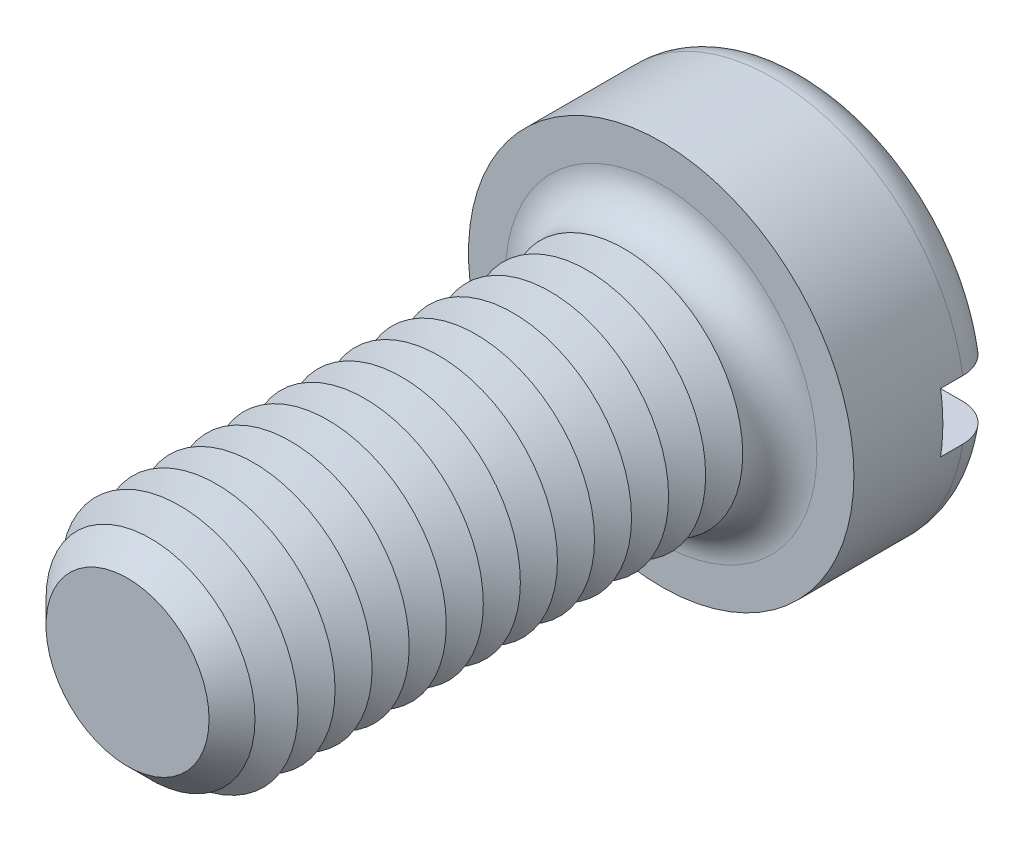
from build123d import *

# Parameters (mm, degrees)
SKETCH3_R           = 6.5
BOSS_EXTRUDE2_DEPTH = 5
SKETCH4_R           = 4
BOSS_EXTRUDE3_DEPTH = 18
FILLET1_R           = 1.25
CHAMFER1_SIZE       = 1.25
LPATTERN1_COUNT     = 13
LPATTERN1_PITCH     = 1.25
SKETCH8_W           = 13
SKETCH8_H           = 2
CUT_EXTRUDE1_DEPTH  = 2


with BuildPart() as part:
    # Sketch3 → Boss-Extrude2 (new body)
    with BuildSketch(Plane.XY):
        Circle(SKETCH3_R)
    extrude(amount=-BOSS_EXTRUDE2_DEPTH)

    # Sketch4 → Boss-Extrude3 (add)
    with BuildSketch(Plane.XY):
        Circle(SKETCH4_R)
    extrude(amount=BOSS_EXTRUDE3_DEPTH)

    # Fillet1
    fillet1_edges = [part.edges().sort_by_distance(p)[0] for p in [
        (-6.5, 0, -5),
        (-4, 0, 0),
    ]]
    fillet(fillet1_edges, radius=FILLET1_R)

    # Chamfer1
    chamfer1_edges = [part.edges().sort_by_distance(p)[0] for p in [
        (-4, 0, 18),
    ]]
    chamfer(chamfer1_edges, length=CHAMFER1_SIZE)

    # Sketch6 → Cut-Revolve1 (revolve, cut)
    with BuildSketch(Plane(origin=(0, 0, 0), x_dir=(0, 0, -1), z_dir=(1, 0, 0)), mode=Mode.PRIVATE) as cut_revolve1_sk:
        Polygon((-1.25, 4), (-1.875, 2.917468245), (-2.5, 4), align=None)
    cut_revolve1 = revolve(cut_revolve1_sk.sketch.rotate(Axis((0, 0, -1.694361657), (0, 0, 1)), 90), axis=Axis((0, 0, -1.694361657), (0, 0, 1)), mode=Mode.SUBTRACT)

    # LPattern1: Cut-Revolve1 ×13
    with Locations(*[(0, 0, i * LPATTERN1_PITCH) for i in range(1, LPATTERN1_COUNT)]):
        add(cut_revolve1, mode=Mode.SUBTRACT)

    # Sketch8 → Cut-Extrude1 (cut)
    with BuildSketch(Plane(origin=(0, 0, -5), x_dir=(-1, 0, 0), z_dir=(0, 0, -1))):
        Rectangle(SKETCH8_W, SKETCH8_H)
    extrude(amount=-CUT_EXTRUDE1_DEPTH, mode=Mode.SUBTRACT)


solid = part.part
